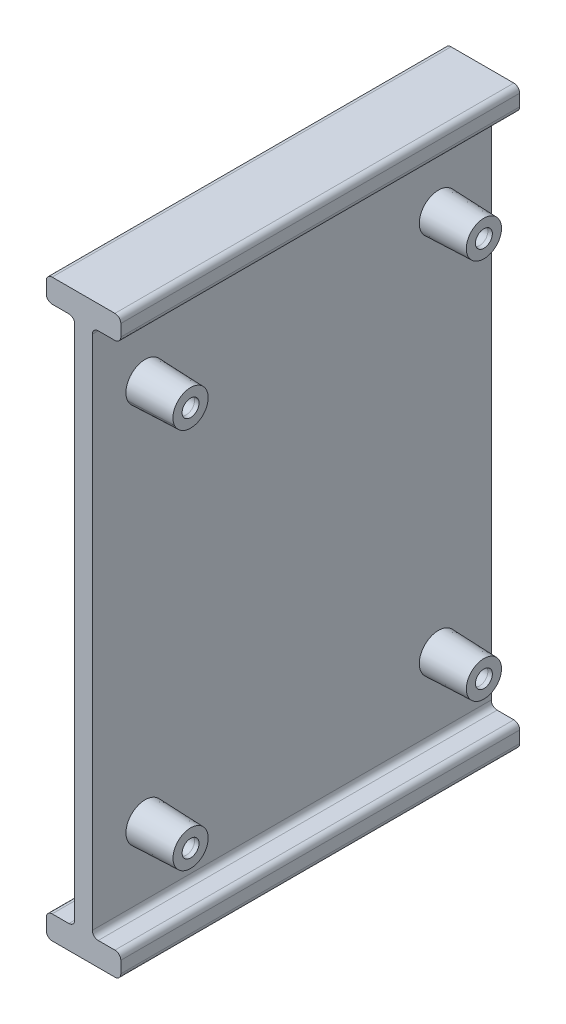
ISO-10303-21;
HEADER;
FILE_DESCRIPTION(('STEP AP214'),'2;1');
FILE_NAME('part.step','',(''),(''),'','','');
FILE_SCHEMA(('AUTOMOTIVE_DESIGN { 1 0 10303 214 1 1 1 1 }'));
ENDSEC;
DATA;
#1=APPLICATION_CONTEXT('core data for automotive mechanical design processes');
#2=APPLICATION_PROTOCOL_DEFINITION('international standard','automotive_design',2000,#1);
#3=PRODUCT_CONTEXT('',#1,'mechanical');
#4=PRODUCT('Part','Part','',(#3));
#5=PRODUCT_RELATED_PRODUCT_CATEGORY('part','',(#4));
#6=PRODUCT_DEFINITION_FORMATION('','',#4);
#7=PRODUCT_DEFINITION_CONTEXT('part definition',#1,'design');
#8=PRODUCT_DEFINITION('design','',#6,#7);
#9=PRODUCT_DEFINITION_SHAPE('','',#8);
#10=(LENGTH_UNIT() NAMED_UNIT(*) SI_UNIT(.MILLI.,.METRE.));
#11=(NAMED_UNIT(*) PLANE_ANGLE_UNIT() SI_UNIT($,.RADIAN.));
#12=(NAMED_UNIT(*) SI_UNIT($,.STERADIAN.) SOLID_ANGLE_UNIT());
#13=UNCERTAINTY_MEASURE_WITH_UNIT(LENGTH_MEASURE(1.E-05),#10,'distance_accuracy_value','');
#14=(GEOMETRIC_REPRESENTATION_CONTEXT(3) GLOBAL_UNCERTAINTY_ASSIGNED_CONTEXT((#13)) GLOBAL_UNIT_ASSIGNED_CONTEXT((#10,
#11,#12)) REPRESENTATION_CONTEXT('',''));
#15=CARTESIAN_POINT('',(0.,0.,0.));
#16=DIRECTION('',(0.,0.,1.));
#17=DIRECTION('',(1.,0.,0.));
#18=AXIS2_PLACEMENT_3D('',#15,#16,#17);
#19=CARTESIAN_POINT('',(8.5,32.5035799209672,25.0016124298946));
#20=DIRECTION('',(1.,0.,0.));
#21=DIRECTION('',(0.,0.,-1.));
#22=AXIS2_PLACEMENT_3D('',#19,#20,#21);
#23=PLANE('',#22);
#24=CARTESIAN_POINT('',(8.5,32.5035799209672,25.0016124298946));
#25=DIRECTION('',(1.,0.,0.));
#26=DIRECTION('',(0.,0.,-1.));
#27=AXIS2_PLACEMENT_3D('',#24,#25,#26);
#28=CIRCLE('',#27,1.42381407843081);
#29=CARTESIAN_POINT('',(8.5,31.9170656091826,26.299012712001));
#30=VERTEX_POINT('',#29);
#31=CARTESIAN_POINT('',(8.5,33.0865143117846,23.7025997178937));
#32=VERTEX_POINT('',#31);
#33=EDGE_CURVE('E257',#30,#32,#28,.T.);
#34=ORIENTED_EDGE('',*,*,#33,.T.);
#35=CARTESIAN_POINT('',(8.5,32.5,25.));
#36=DIRECTION('',(1.,0.,0.));
#37=DIRECTION('',(0.,0.,-1.));
#38=AXIS2_PLACEMENT_3D('',#35,#36,#37);
#39=CIRCLE('',#38,1.42381407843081);
#40=EDGE_CURVE('E264',#32,#30,#39,.T.);
#41=ORIENTED_EDGE('',*,*,#40,.T.);
#42=EDGE_LOOP('',(#34,#41));
#43=FACE_BOUND('',#42,.T.);
#44=CARTESIAN_POINT('',(8.5,32.5,25.));
#45=DIRECTION('',(-1.,0.,0.));
#46=DIRECTION('',(0.,0.,1.));
#47=AXIS2_PLACEMENT_3D('',#44,#45,#46);
#48=CIRCLE('',#47,1.45);
#49=CARTESIAN_POINT('',(8.5,31.9063116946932,26.3228885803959));
#50=VERTEX_POINT('',#49);
#51=CARTESIAN_POINT('',(8.5,33.0972682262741,23.6787238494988));
#52=VERTEX_POINT('',#51);
#53=EDGE_CURVE('E269',#50,#52,#48,.T.);
#54=ORIENTED_EDGE('',*,*,#53,.T.);
#55=CARTESIAN_POINT('',(8.5,32.5035799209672,25.0016124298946));
#56=DIRECTION('',(-1.,0.,0.));
#57=DIRECTION('',(0.,0.,1.));
#58=AXIS2_PLACEMENT_3D('',#55,#56,#57);
#59=CIRCLE('',#58,1.45);
#60=EDGE_CURVE('E285',#52,#50,#59,.T.);
#61=ORIENTED_EDGE('',*,*,#60,.T.);
#62=EDGE_LOOP('',(#54,#61));
#63=FACE_BOUND('',#62,.T.);
#64=ADVANCED_FACE('F45',(#43,#63),#23,.F.);
#65=CARTESIAN_POINT('',(2.5,32.5035799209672,25.0016124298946));
#66=DIRECTION('',(-1.,0.,0.));
#67=DIRECTION('',(0.,0.,1.));
#68=AXIS2_PLACEMENT_3D('',#65,#66,#67);
#69=PLANE('',#68);
#70=CARTESIAN_POINT('',(2.5,32.5,25.));
#71=DIRECTION('',(1.,0.,0.));
#72=DIRECTION('',(0.,0.,-1.));
#73=AXIS2_PLACEMENT_3D('',#70,#71,#72);
#74=CIRCLE('',#73,1.34526961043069);
#75=CARTESIAN_POINT('',(2.5,33.0542580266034,23.7742152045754));
#76=VERTEX_POINT('',#75);
#77=CARTESIAN_POINT('',(2.5,31.9493218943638,26.2273972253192));
#78=VERTEX_POINT('',#77);
#79=EDGE_CURVE('E277',#76,#78,#74,.T.);
#80=ORIENTED_EDGE('',*,*,#79,.T.);
#81=CARTESIAN_POINT('',(2.5,32.5035799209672,25.0016124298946));
#82=DIRECTION('',(1.,0.,0.));
#83=DIRECTION('',(0.,0.,-1.));
#84=AXIS2_PLACEMENT_3D('',#81,#82,#83);
#85=CIRCLE('',#84,1.34526961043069);
#86=EDGE_CURVE('E282',#78,#76,#85,.T.);
#87=ORIENTED_EDGE('',*,*,#86,.T.);
#88=EDGE_LOOP('',(#80,#87));
#89=FACE_BOUND('',#88,.T.);
#90=ADVANCED_FACE('F522',(#89),#69,.F.);
#91=CARTESIAN_POINT('',(2.5,32.5035799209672,25.0016124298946));
#92=DIRECTION('',(1.,0.,0.));
#93=DIRECTION('',(0.,0.,-1.));
#94=AXIS2_PLACEMENT_3D('',#91,#92,#93);
#95=CONICAL_SURFACE('',#94,1.34526961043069,0.0174532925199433);
#96=CARTESIAN_POINT('',(9.1002,31.902009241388,26.3324408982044));
#97=CARTESIAN_POINT('',(8.14339580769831,31.9088679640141,26.3172131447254));
#98=CARTESIAN_POINT('',(7.18659161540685,31.915726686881,26.3019853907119));
#99=CARTESIAN_POINT('',(4.78645828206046,31.9329317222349,26.2637867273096));
#100=CARTESIAN_POINT('',(3.34312914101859,31.943278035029,26.240815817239));
#101=CARTESIAN_POINT('',(1.8998,31.953624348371,26.2178449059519));
#102=B_SPLINE_CURVE_WITH_KNOTS('',3,(#96,#97,#98,#99,#100,#101),.UNSPECIFIED.,.F.,.F.,(4,2,4),
(0.,2.87084982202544,7.20149682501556),.UNSPECIFIED.);
#103=EDGE_CURVE('E507',#50,#78,#102,.T.);
#104=ORIENTED_EDGE('',*,*,#103,.F.);
#105=ORIENTED_EDGE('',*,*,#60,.F.);
#106=CARTESIAN_POINT('',(1.8998,33.0499555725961,23.7837675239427));
#107=CARTESIAN_POINT('',(2.77426500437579,33.0562240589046,23.7698502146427));
#108=CARTESIAN_POINT('',(3.64873000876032,33.0624925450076,23.7559329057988));
#109=CARTESIAN_POINT('',(6.04886334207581,33.0796975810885,23.7177342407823));
#110=CARTESIAN_POINT('',(7.57453167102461,33.0906341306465,23.693452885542));
#111=CARTESIAN_POINT('',(9.1002,33.1015706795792,23.6691715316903));
#112=B_SPLINE_CURVE_WITH_KNOTS('',3,(#106,#107,#108,#109,#110,#111),.UNSPECIFIED.,.F.,.F.,(4,2,
4),(0.,2.62379463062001,7.20149682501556),.UNSPECIFIED.);
#113=EDGE_CURVE('E500',#76,#52,#112,.T.);
#114=ORIENTED_EDGE('',*,*,#113,.F.);
#115=ORIENTED_EDGE('',*,*,#86,.F.);
#116=EDGE_LOOP('',(#104,#105,#114,#115));
#117=FACE_BOUND('',#116,.T.);
#118=ADVANCED_FACE('F517',(#117),#95,.F.);
#119=CARTESIAN_POINT('',(8.5,32.5035799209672,25.0016124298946));
#120=DIRECTION('',(1.,0.,0.));
#121=DIRECTION('',(0.,0.,-1.));
#122=AXIS2_PLACEMENT_3D('',#119,#120,#121);
#123=CONICAL_SURFACE('',#122,1.42381407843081,0.0261799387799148);
#124=CARTESIAN_POINT('',(9.32080000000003,31.9082387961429,26.3186100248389));
#125=CARTESIAN_POINT('',(9.17153333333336,31.9098439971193,26.3150461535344));
#126=CARTESIAN_POINT('',(9.02226666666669,31.9114491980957,26.31148228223));
#127=CARTESIAN_POINT('',(8.72373333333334,31.9146596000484,26.304354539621));
#128=CARTESIAN_POINT('',(8.57446666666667,31.9162648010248,26.3007906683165));
#129=CARTESIAN_POINT('',(8.42519999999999,31.9178700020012,26.297226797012));
#130=B_SPLINE_CURVE_WITH_KNOTS('',3,(#124,#125,#126,#127,#128,#129),.UNSPECIFIED.,.F.,.F.,(4,2,
4),(0.,0.447953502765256,0.895907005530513),.UNSPECIFIED.);
#131=CARTESIAN_POINT('',(9.24600000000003,31.9090431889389,26.3168241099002));
#132=VERTEX_POINT('',#131);
#133=EDGE_CURVE('E252',#132,#30,#130,.T.);
#134=ORIENTED_EDGE('',*,*,#133,.F.);
#135=CARTESIAN_POINT('',(9.24600000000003,32.5035799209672,25.0016124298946));
#136=DIRECTION('',(1.,0.,0.));
#137=DIRECTION('',(0.,1.,0.));
#138=AXIS2_PLACEMENT_3D('',#135,#136,#137);
#139=CIRCLE('',#138,1.44334877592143);
#140=CARTESIAN_POINT('',(9.24600000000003,33.0945367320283,23.6847883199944));
#141=VERTEX_POINT('',#140);
#142=EDGE_CURVE('E246',#132,#141,#139,.T.);
#143=ORIENTED_EDGE('',*,*,#142,.T.);
#144=CARTESIAN_POINT('',(8.42519999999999,33.0857099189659,23.7043856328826));
#145=CARTESIAN_POINT('',(8.57446666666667,33.0873151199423,23.7008217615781));
#146=CARTESIAN_POINT('',(8.72373333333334,33.0889203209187,23.6972578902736));
#147=CARTESIAN_POINT('',(9.02226666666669,33.0921307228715,23.6901301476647));
#148=CARTESIAN_POINT('',(9.17153333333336,33.0937359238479,23.6865662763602));
#149=CARTESIAN_POINT('',(9.32080000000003,33.0953411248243,23.6830024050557));
#150=B_SPLINE_CURVE_WITH_KNOTS('',3,(#144,#145,#146,#147,#148,#149),.UNSPECIFIED.,.F.,.F.,(4,2,
4),(0.,0.447953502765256,0.895907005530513),.UNSPECIFIED.);
#151=EDGE_CURVE('E249',#32,#141,#150,.T.);
#152=ORIENTED_EDGE('',*,*,#151,.F.);
#153=ORIENTED_EDGE('',*,*,#33,.F.);
#154=EDGE_LOOP('',(#134,#143,#152,#153));
#155=FACE_BOUND('',#154,.T.);
#156=ADVANCED_FACE('F248',(#155),#123,.F.);
#157=CARTESIAN_POINT('',(-5.35,-48.,34.));
#158=DIRECTION('',(0.,0.,-1.));
#159=DIRECTION('',(-1.,0.,0.));
#160=AXIS2_PLACEMENT_3D('',#157,#158,#159);
#161=CYLINDRICAL_SURFACE('',#160,1.);
#162=CARTESIAN_POINT('',(-5.35,-48.,-34.));
#163=DIRECTION('',(0.,0.,1.));
#164=DIRECTION('',(1.,0.,0.));
#165=AXIS2_PLACEMENT_3D('',#162,#163,#164);
#166=CIRCLE('',#165,1.);
#167=CARTESIAN_POINT('',(-5.34999999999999,-49.,-34.));
#168=VERTEX_POINT('',#167);
#169=CARTESIAN_POINT('',(-6.35,-48.,-34.));
#170=VERTEX_POINT('',#169);
#171=EDGE_CURVE('E292',#168,#170,#166,.F.);
#172=ORIENTED_EDGE('',*,*,#171,.F.);
#173=DIRECTION('',(0.,0.,-1.));
#174=VECTOR('',#173,1.);
#175=CARTESIAN_POINT('',(-5.34999999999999,-49.,34.));
#176=LINE('',#175,#174);
#177=CARTESIAN_POINT('',(-5.34999999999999,-49.,34.));
#178=VERTEX_POINT('',#177);
#179=EDGE_CURVE('E265',#178,#168,#176,.T.);
#180=ORIENTED_EDGE('',*,*,#179,.F.);
#181=CARTESIAN_POINT('',(-5.35,-48.,34.));
#182=DIRECTION('',(0.,0.,1.));
#183=DIRECTION('',(1.,0.,0.));
#184=AXIS2_PLACEMENT_3D('',#181,#182,#183);
#185=CIRCLE('',#184,1.);
#186=CARTESIAN_POINT('',(-6.35,-48.,34.));
#187=VERTEX_POINT('',#186);
#188=EDGE_CURVE('E293',#178,#187,#185,.F.);
#189=ORIENTED_EDGE('',*,*,#188,.T.);
#190=DIRECTION('',(0.,0.,-1.));
#191=VECTOR('',#190,1.);
#192=CARTESIAN_POINT('',(-6.35,-48.,34.));
#193=LINE('',#192,#191);
#194=EDGE_CURVE('E355',#187,#170,#193,.T.);
#195=ORIENTED_EDGE('',*,*,#194,.T.);
#196=EDGE_LOOP('',(#172,#180,#189,#195));
#197=FACE_BOUND('',#196,.T.);
#198=ADVANCED_FACE('F47',(#197),#161,.T.);
#199=CARTESIAN_POINT('',(0.,-49.,34.));
#200=DIRECTION('',(0.,1.,0.));
#201=DIRECTION('',(0.,0.,1.));
#202=AXIS2_PLACEMENT_3D('',#199,#200,#201);
#203=PLANE('',#202);
#204=DIRECTION('',(1.,0.,0.));
#205=VECTOR('',#204,1.);
#206=CARTESIAN_POINT('',(0.,-49.,-34.));
#207=LINE('',#206,#205);
#208=CARTESIAN_POINT('',(5.34999999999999,-49.,-34.));
#209=VERTEX_POINT('',#208);
#210=EDGE_CURVE('E358',#168,#209,#207,.T.);
#211=ORIENTED_EDGE('',*,*,#210,.T.);
#212=DIRECTION('',(0.,0.,-1.));
#213=VECTOR('',#212,1.);
#214=CARTESIAN_POINT('',(5.34999999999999,-49.,34.));
#215=LINE('',#214,#213);
#216=CARTESIAN_POINT('',(5.34999999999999,-49.,34.));
#217=VERTEX_POINT('',#216);
#218=EDGE_CURVE('E468',#217,#209,#215,.T.);
#219=ORIENTED_EDGE('',*,*,#218,.F.);
#220=DIRECTION('',(1.,0.,0.));
#221=VECTOR('',#220,1.);
#222=CARTESIAN_POINT('',(0.,-49.,34.));
#223=LINE('',#222,#221);
#224=EDGE_CURVE('E296',#178,#217,#223,.T.);
#225=ORIENTED_EDGE('',*,*,#224,.F.);
#226=ORIENTED_EDGE('',*,*,#179,.T.);
#227=EDGE_LOOP('',(#211,#219,#225,#226));
#228=FACE_BOUND('',#227,.T.);
#229=ADVANCED_FACE('F625',(#228),#203,.F.);
#230=CARTESIAN_POINT('',(5.35,-48.,34.));
#231=DIRECTION('',(0.,0.,-1.));
#232=DIRECTION('',(-1.,0.,0.));
#233=AXIS2_PLACEMENT_3D('',#230,#231,#232);
#234=CYLINDRICAL_SURFACE('',#233,1.);
#235=CARTESIAN_POINT('',(5.35,-48.,-34.));
#236=DIRECTION('',(0.,0.,1.));
#237=DIRECTION('',(1.,0.,0.));
#238=AXIS2_PLACEMENT_3D('',#235,#236,#237);
#239=CIRCLE('',#238,1.);
#240=CARTESIAN_POINT('',(6.35,-48.,-34.));
#241=VERTEX_POINT('',#240);
#242=EDGE_CURVE('E360',#209,#241,#239,.T.);
#243=ORIENTED_EDGE('',*,*,#242,.T.);
#244=DIRECTION('',(0.,0.,-1.));
#245=VECTOR('',#244,1.);
#246=CARTESIAN_POINT('',(6.35,-48.,34.));
#247=LINE('',#246,#245);
#248=CARTESIAN_POINT('',(6.35,-48.,34.));
#249=VERTEX_POINT('',#248);
#250=EDGE_CURVE('E465',#249,#241,#247,.T.);
#251=ORIENTED_EDGE('',*,*,#250,.F.);
#252=CARTESIAN_POINT('',(5.35,-48.,34.));
#253=DIRECTION('',(0.,0.,1.));
#254=DIRECTION('',(1.,0.,0.));
#255=AXIS2_PLACEMENT_3D('',#252,#253,#254);
#256=CIRCLE('',#255,1.);
#257=EDGE_CURVE('E299',#217,#249,#256,.T.);
#258=ORIENTED_EDGE('',*,*,#257,.F.);
#259=ORIENTED_EDGE('',*,*,#218,.T.);
#260=EDGE_LOOP('',(#243,#251,#258,#259));
#261=FACE_BOUND('',#260,.T.);
#262=ADVANCED_FACE('F622',(#261),#234,.T.);
#263=CARTESIAN_POINT('',(6.35,0.,34.));
#264=DIRECTION('',(-1.,0.,0.));
#265=DIRECTION('',(0.,0.,1.));
#266=AXIS2_PLACEMENT_3D('',#263,#264,#265);
#267=PLANE('',#266);
#268=DIRECTION('',(0.,1.,0.));
#269=VECTOR('',#268,1.);
#270=CARTESIAN_POINT('',(6.35,0.,-34.));
#271=LINE('',#270,#269);
#272=CARTESIAN_POINT('',(6.35,-46.,-34.));
#273=VERTEX_POINT('',#272);
#274=EDGE_CURVE('E362',#241,#273,#271,.T.);
#275=ORIENTED_EDGE('',*,*,#274,.T.);
#276=DIRECTION('',(0.,0.,-1.));
#277=VECTOR('',#276,1.);
#278=CARTESIAN_POINT('',(6.35,-46.,34.));
#279=LINE('',#278,#277);
#280=CARTESIAN_POINT('',(6.35,-46.,34.));
#281=VERTEX_POINT('',#280);
#282=EDGE_CURVE('E463',#281,#273,#279,.T.);
#283=ORIENTED_EDGE('',*,*,#282,.F.);
#284=DIRECTION('',(0.,1.,0.));
#285=VECTOR('',#284,1.);
#286=CARTESIAN_POINT('',(6.35,0.,34.));
#287=LINE('',#286,#285);
#288=EDGE_CURVE('E301',#249,#281,#287,.T.);
#289=ORIENTED_EDGE('',*,*,#288,.F.);
#290=ORIENTED_EDGE('',*,*,#250,.T.);
#291=EDGE_LOOP('',(#275,#283,#289,#290));
#292=FACE_BOUND('',#291,.T.);
#293=ADVANCED_FACE('F618',(#292),#267,.F.);
#294=CARTESIAN_POINT('',(5.35,-46.,34.));
#295=DIRECTION('',(0.,0.,-1.));
#296=DIRECTION('',(-1.,0.,0.));
#297=AXIS2_PLACEMENT_3D('',#294,#295,#296);
#298=CYLINDRICAL_SURFACE('',#297,1.);
#299=CARTESIAN_POINT('',(5.35,-46.,-34.));
#300=DIRECTION('',(0.,0.,1.));
#301=DIRECTION('',(1.,0.,0.));
#302=AXIS2_PLACEMENT_3D('',#299,#300,#301);
#303=CIRCLE('',#302,1.);
#304=CARTESIAN_POINT('',(5.35,-45.,-34.));
#305=VERTEX_POINT('',#304);
#306=EDGE_CURVE('E365',#305,#273,#303,.F.);
#307=ORIENTED_EDGE('',*,*,#306,.F.);
#308=DIRECTION('',(0.,0.,-1.));
#309=VECTOR('',#308,1.);
#310=CARTESIAN_POINT('',(5.35,-45.,34.));
#311=LINE('',#310,#309);
#312=CARTESIAN_POINT('',(5.35,-45.,34.));
#313=VERTEX_POINT('',#312);
#314=EDGE_CURVE('E461',#313,#305,#311,.T.);
#315=ORIENTED_EDGE('',*,*,#314,.F.);
#316=CARTESIAN_POINT('',(5.35,-46.,34.));
#317=DIRECTION('',(0.,0.,1.));
#318=DIRECTION('',(1.,0.,0.));
#319=AXIS2_PLACEMENT_3D('',#316,#317,#318);
#320=CIRCLE('',#319,1.);
#321=EDGE_CURVE('E303',#313,#281,#320,.F.);
#322=ORIENTED_EDGE('',*,*,#321,.T.);
#323=ORIENTED_EDGE('',*,*,#282,.T.);
#324=EDGE_LOOP('',(#307,#315,#322,#323));
#325=FACE_BOUND('',#324,.T.);
#326=ADVANCED_FACE('F614',(#325),#298,.T.);
#327=CARTESIAN_POINT('',(-1.09561482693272E-13,-45.,34.));
#328=DIRECTION('',(0.,1.,0.));
#329=DIRECTION('',(-1.,0.,0.));
#330=AXIS2_PLACEMENT_3D('',#327,#328,#329);
#331=PLANE('',#330);
#332=DIRECTION('',(1.,0.,0.));
#333=VECTOR('',#332,1.);
#334=CARTESIAN_POINT('',(-1.09561482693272E-13,-45.,-34.));
#335=LINE('',#334,#333);
#336=CARTESIAN_POINT('',(2.50000000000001,-45.,-34.));
#337=VERTEX_POINT('',#336);
#338=EDGE_CURVE('E368',#337,#305,#335,.T.);
#339=ORIENTED_EDGE('',*,*,#338,.F.);
#340=DIRECTION('',(0.,0.,-1.));
#341=VECTOR('',#340,1.);
#342=CARTESIAN_POINT('',(2.50000000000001,-45.,34.));
#343=LINE('',#342,#341);
#344=CARTESIAN_POINT('',(2.50000000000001,-45.,34.));
#345=VERTEX_POINT('',#344);
#346=EDGE_CURVE('E459',#345,#337,#343,.T.);
#347=ORIENTED_EDGE('',*,*,#346,.F.);
#348=DIRECTION('',(1.,0.,0.));
#349=VECTOR('',#348,1.);
#350=CARTESIAN_POINT('',(-1.09561482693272E-13,-45.,34.));
#351=LINE('',#350,#349);
#352=EDGE_CURVE('E306',#345,#313,#351,.T.);
#353=ORIENTED_EDGE('',*,*,#352,.T.);
#354=ORIENTED_EDGE('',*,*,#314,.T.);
#355=EDGE_LOOP('',(#339,#347,#353,#354));
#356=FACE_BOUND('',#355,.T.);
#357=ADVANCED_FACE('F610',(#356),#331,.T.);
#358=CARTESIAN_POINT('',(2.5,-44.,34.));
#359=DIRECTION('',(0.,0.,-1.));
#360=DIRECTION('',(-1.,0.,0.));
#361=AXIS2_PLACEMENT_3D('',#358,#359,#360);
#362=CYLINDRICAL_SURFACE('',#361,1.);
#363=CARTESIAN_POINT('',(2.5,-44.,-34.));
#364=DIRECTION('',(0.,0.,1.));
#365=DIRECTION('',(1.,0.,0.));
#366=AXIS2_PLACEMENT_3D('',#363,#364,#365);
#367=CIRCLE('',#366,1.);
#368=CARTESIAN_POINT('',(1.5,-44.,-34.));
#369=VERTEX_POINT('',#368);
#370=EDGE_CURVE('E371',#337,#369,#367,.F.);
#371=ORIENTED_EDGE('',*,*,#370,.T.);
#372=DIRECTION('',(0.,0.,-1.));
#373=VECTOR('',#372,1.);
#374=CARTESIAN_POINT('',(1.5,-44.,34.));
#375=LINE('',#374,#373);
#376=CARTESIAN_POINT('',(1.5,-44.,34.));
#377=VERTEX_POINT('',#376);
#378=EDGE_CURVE('E456',#377,#369,#375,.T.);
#379=ORIENTED_EDGE('',*,*,#378,.F.);
#380=CARTESIAN_POINT('',(2.5,-44.,34.));
#381=DIRECTION('',(0.,0.,1.));
#382=DIRECTION('',(1.,0.,0.));
#383=AXIS2_PLACEMENT_3D('',#380,#381,#382);
#384=CIRCLE('',#383,1.);
#385=EDGE_CURVE('E309',#345,#377,#384,.F.);
#386=ORIENTED_EDGE('',*,*,#385,.F.);
#387=ORIENTED_EDGE('',*,*,#346,.T.);
#388=EDGE_LOOP('',(#371,#379,#386,#387));
#389=FACE_BOUND('',#388,.T.);
#390=ADVANCED_FACE('F606',(#389),#362,.F.);
#391=CARTESIAN_POINT('',(1.5,0.,34.));
#392=DIRECTION('',(-1.,0.,0.));
#393=DIRECTION('',(0.,-1.,0.));
#394=AXIS2_PLACEMENT_3D('',#391,#392,#393);
#395=PLANE('',#394);
#396=CARTESIAN_POINT('',(1.49999999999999,-32.5,25.));
#397=DIRECTION('',(-1.,0.,0.));
#398=DIRECTION('',(0.,-1.,0.));
#399=AXIS2_PLACEMENT_3D('',#396,#397,#398);
#400=CIRCLE('',#399,3.27056445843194);
#401=CARTESIAN_POINT('',(1.49999999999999,-35.7705644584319,25.));
#402=VERTEX_POINT('',#401);
#403=EDGE_CURVE('E1142',#402,#402,#400,.F.);
#404=ORIENTED_EDGE('',*,*,#403,.F.);
#405=EDGE_LOOP('',(#404));
#406=FACE_BOUND('',#405,.T.);
#407=CARTESIAN_POINT('',(1.49999999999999,-32.5,-25.));
#408=DIRECTION('',(-1.,0.,0.));
#409=DIRECTION('',(0.,-1.,0.));
#410=AXIS2_PLACEMENT_3D('',#407,#408,#409);
#411=CIRCLE('',#410,3.27056445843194);
#412=CARTESIAN_POINT('',(1.49999999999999,-35.770564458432,-25.));
#413=VERTEX_POINT('',#412);
#414=EDGE_CURVE('E1151',#413,#413,#411,.F.);
#415=ORIENTED_EDGE('',*,*,#414,.F.);
#416=EDGE_LOOP('',(#415));
#417=FACE_BOUND('',#416,.T.);
#418=CARTESIAN_POINT('',(1.49999999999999,32.5,-25.));
#419=DIRECTION('',(-1.,0.,0.));
#420=DIRECTION('',(0.,-1.,0.));
#421=AXIS2_PLACEMENT_3D('',#418,#419,#420);
#422=CIRCLE('',#421,3.27056445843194);
#423=CARTESIAN_POINT('',(1.49999999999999,29.2294355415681,-25.));
#424=VERTEX_POINT('',#423);
#425=EDGE_CURVE('E1169',#424,#424,#422,.F.);
#426=ORIENTED_EDGE('',*,*,#425,.F.);
#427=EDGE_LOOP('',(#426));
#428=FACE_BOUND('',#427,.T.);
#429=CARTESIAN_POINT('',(1.49999999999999,32.5035799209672,25.0016124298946));
#430=DIRECTION('',(-1.,0.,0.));
#431=DIRECTION('',(0.,-1.,0.));
#432=AXIS2_PLACEMENT_3D('',#429,#430,#431);
#433=CIRCLE('',#432,3.27056445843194);
#434=CARTESIAN_POINT('',(1.49999999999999,33.844928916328,22.0187656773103));
#435=VERTEX_POINT('',#434);
#436=CARTESIAN_POINT('',(1.49999999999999,31.1586510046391,27.9828467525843));
#437=VERTEX_POINT('',#436);
#438=EDGE_CURVE('E290',#435,#437,#433,.F.);
#439=ORIENTED_EDGE('',*,*,#438,.F.);
#440=CARTESIAN_POINT('',(1.49999999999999,32.5,25.));
#441=DIRECTION('',(-1.,0.,0.));
#442=DIRECTION('',(0.,-1.,0.));
#443=AXIS2_PLACEMENT_3D('',#440,#441,#442);
#444=CIRCLE('',#443,3.27056445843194);
#445=EDGE_CURVE('E65',#437,#435,#444,.F.);
#446=ORIENTED_EDGE('',*,*,#445,.F.);
#447=EDGE_LOOP('',(#439,#446));
#448=FACE_BOUND('',#447,.T.);
#449=DIRECTION('',(0.,1.,0.));
#450=VECTOR('',#449,1.);
#451=CARTESIAN_POINT('',(1.5,0.,-34.));
#452=LINE('',#451,#450);
#453=CARTESIAN_POINT('',(1.49999999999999,44.,-34.));
#454=VERTEX_POINT('',#453);
#455=EDGE_CURVE('E373',#369,#454,#452,.T.);
#456=ORIENTED_EDGE('',*,*,#455,.T.);
#457=DIRECTION('',(0.,0.,-1.));
#458=VECTOR('',#457,1.);
#459=CARTESIAN_POINT('',(1.49999999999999,44.,34.));
#460=LINE('',#459,#458);
#461=CARTESIAN_POINT('',(1.49999999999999,44.,34.));
#462=VERTEX_POINT('',#461);
#463=EDGE_CURVE('E454',#462,#454,#460,.T.);
#464=ORIENTED_EDGE('',*,*,#463,.F.);
#465=DIRECTION('',(0.,1.,0.));
#466=VECTOR('',#465,1.);
#467=CARTESIAN_POINT('',(1.5,0.,34.));
#468=LINE('',#467,#466);
#469=EDGE_CURVE('E311',#377,#462,#468,.T.);
#470=ORIENTED_EDGE('',*,*,#469,.F.);
#471=ORIENTED_EDGE('',*,*,#378,.T.);
#472=EDGE_LOOP('',(#456,#464,#470,#471));
#473=FACE_BOUND('',#472,.T.);
#474=ADVANCED_FACE('F602',(#406,#417,#428,#448,#473),#395,.F.);
#475=CARTESIAN_POINT('',(2.49999999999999,44.,34.));
#476=DIRECTION('',(0.,0.,-1.));
#477=DIRECTION('',(-1.,0.,0.));
#478=AXIS2_PLACEMENT_3D('',#475,#476,#477);
#479=CYLINDRICAL_SURFACE('',#478,1.);
#480=CARTESIAN_POINT('',(2.49999999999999,44.,-34.));
#481=DIRECTION('',(0.,0.,1.));
#482=DIRECTION('',(1.,0.,0.));
#483=AXIS2_PLACEMENT_3D('',#480,#481,#482);
#484=CIRCLE('',#483,1.);
#485=CARTESIAN_POINT('',(2.5,45.,-34.));
#486=VERTEX_POINT('',#485);
#487=EDGE_CURVE('E376',#486,#454,#484,.T.);
#488=ORIENTED_EDGE('',*,*,#487,.F.);
#489=DIRECTION('',(0.,0.,-1.));
#490=VECTOR('',#489,1.);
#491=CARTESIAN_POINT('',(2.5,45.,34.));
#492=LINE('',#491,#490);
#493=CARTESIAN_POINT('',(2.5,45.,34.));
#494=VERTEX_POINT('',#493);
#495=EDGE_CURVE('E452',#494,#486,#492,.T.);
#496=ORIENTED_EDGE('',*,*,#495,.F.);
#497=CARTESIAN_POINT('',(2.49999999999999,44.,34.));
#498=DIRECTION('',(0.,0.,1.));
#499=DIRECTION('',(1.,0.,0.));
#500=AXIS2_PLACEMENT_3D('',#497,#498,#499);
#501=CIRCLE('',#500,1.);
#502=EDGE_CURVE('E313',#494,#462,#501,.T.);
#503=ORIENTED_EDGE('',*,*,#502,.T.);
#504=ORIENTED_EDGE('',*,*,#463,.T.);
#505=EDGE_LOOP('',(#488,#496,#503,#504));
#506=FACE_BOUND('',#505,.T.);
#507=ADVANCED_FACE('F598',(#506),#479,.F.);
#508=CARTESIAN_POINT('',(-1.09561482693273E-13,45.,34.));
#509=DIRECTION('',(0.,1.,0.));
#510=DIRECTION('',(-1.,0.,0.));
#511=AXIS2_PLACEMENT_3D('',#508,#509,#510);
#512=PLANE('',#511);
#513=DIRECTION('',(1.,0.,0.));
#514=VECTOR('',#513,1.);
#515=CARTESIAN_POINT('',(-1.09561482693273E-13,45.,-34.));
#516=LINE('',#515,#514);
#517=CARTESIAN_POINT('',(5.34999999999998,45.,-34.));
#518=VERTEX_POINT('',#517);
#519=EDGE_CURVE('E379',#486,#518,#516,.T.);
#520=ORIENTED_EDGE('',*,*,#519,.T.);
#521=DIRECTION('',(0.,0.,-1.));
#522=VECTOR('',#521,1.);
#523=CARTESIAN_POINT('',(5.34999999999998,45.,34.));
#524=LINE('',#523,#522);
#525=CARTESIAN_POINT('',(5.34999999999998,45.,34.));
#526=VERTEX_POINT('',#525);
#527=EDGE_CURVE('E449',#526,#518,#524,.T.);
#528=ORIENTED_EDGE('',*,*,#527,.F.);
#529=DIRECTION('',(1.,0.,0.));
#530=VECTOR('',#529,1.);
#531=CARTESIAN_POINT('',(-1.09561482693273E-13,45.,34.));
#532=LINE('',#531,#530);
#533=EDGE_CURVE('E316',#494,#526,#532,.T.);
#534=ORIENTED_EDGE('',*,*,#533,.F.);
#535=ORIENTED_EDGE('',*,*,#495,.T.);
#536=EDGE_LOOP('',(#520,#528,#534,#535));
#537=FACE_BOUND('',#536,.T.);
#538=ADVANCED_FACE('F594',(#537),#512,.F.);
#539=CARTESIAN_POINT('',(5.34999999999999,46.,34.));
#540=DIRECTION('',(0.,0.,-1.));
#541=DIRECTION('',(-1.,0.,0.));
#542=AXIS2_PLACEMENT_3D('',#539,#540,#541);
#543=CYLINDRICAL_SURFACE('',#542,1.);
#544=CARTESIAN_POINT('',(5.34999999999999,46.,-34.));
#545=DIRECTION('',(0.,0.,1.));
#546=DIRECTION('',(1.,0.,0.));
#547=AXIS2_PLACEMENT_3D('',#544,#545,#546);
#548=CIRCLE('',#547,1.);
#549=CARTESIAN_POINT('',(6.34999999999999,46.,-34.));
#550=VERTEX_POINT('',#549);
#551=EDGE_CURVE('E381',#518,#550,#548,.T.);
#552=ORIENTED_EDGE('',*,*,#551,.T.);
#553=DIRECTION('',(0.,0.,-1.));
#554=VECTOR('',#553,1.);
#555=CARTESIAN_POINT('',(6.34999999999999,46.,34.));
#556=LINE('',#555,#554);
#557=CARTESIAN_POINT('',(6.34999999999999,46.,34.));
#558=VERTEX_POINT('',#557);
#559=EDGE_CURVE('E447',#558,#550,#556,.T.);
#560=ORIENTED_EDGE('',*,*,#559,.F.);
#561=CARTESIAN_POINT('',(5.34999999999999,46.,34.));
#562=DIRECTION('',(0.,0.,1.));
#563=DIRECTION('',(1.,0.,0.));
#564=AXIS2_PLACEMENT_3D('',#561,#562,#563);
#565=CIRCLE('',#564,1.);
#566=EDGE_CURVE('E318',#526,#558,#565,.T.);
#567=ORIENTED_EDGE('',*,*,#566,.F.);
#568=ORIENTED_EDGE('',*,*,#527,.T.);
#569=EDGE_LOOP('',(#552,#560,#567,#568));
#570=FACE_BOUND('',#569,.T.);
#571=ADVANCED_FACE('F590',(#570),#543,.T.);
#572=CARTESIAN_POINT('',(6.35000000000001,0.,34.));
#573=DIRECTION('',(1.,0.,0.));
#574=DIRECTION('',(0.,1.,0.));
#575=AXIS2_PLACEMENT_3D('',#572,#573,#574);
#576=PLANE('',#575);
#577=DIRECTION('',(0.,-1.,0.));
#578=VECTOR('',#577,1.);
#579=CARTESIAN_POINT('',(6.35000000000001,0.,-34.));
#580=LINE('',#579,#578);
#581=CARTESIAN_POINT('',(6.34999999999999,48.,-34.));
#582=VERTEX_POINT('',#581);
#583=EDGE_CURVE('E384',#582,#550,#580,.T.);
#584=ORIENTED_EDGE('',*,*,#583,.F.);
#585=DIRECTION('',(0.,0.,-1.));
#586=VECTOR('',#585,1.);
#587=CARTESIAN_POINT('',(6.34999999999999,48.,34.));
#588=LINE('',#587,#586);
#589=CARTESIAN_POINT('',(6.34999999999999,48.,34.));
#590=VERTEX_POINT('',#589);
#591=EDGE_CURVE('E445',#590,#582,#588,.T.);
#592=ORIENTED_EDGE('',*,*,#591,.F.);
#593=DIRECTION('',(0.,-1.,0.));
#594=VECTOR('',#593,1.);
#595=CARTESIAN_POINT('',(6.35000000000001,0.,34.));
#596=LINE('',#595,#594);
#597=EDGE_CURVE('E320',#590,#558,#596,.T.);
#598=ORIENTED_EDGE('',*,*,#597,.T.);
#599=ORIENTED_EDGE('',*,*,#559,.T.);
#600=EDGE_LOOP('',(#584,#592,#598,#599));
#601=FACE_BOUND('',#600,.T.);
#602=ADVANCED_FACE('F586',(#601),#576,.T.);
#603=CARTESIAN_POINT('',(5.34999999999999,48.,34.));
#604=DIRECTION('',(0.,0.,-1.));
#605=DIRECTION('',(-1.,0.,0.));
#606=AXIS2_PLACEMENT_3D('',#603,#604,#605);
#607=CYLINDRICAL_SURFACE('',#606,1.);
#608=CARTESIAN_POINT('',(5.34999999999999,48.,-34.));
#609=DIRECTION('',(0.,0.,1.));
#610=DIRECTION('',(1.,0.,0.));
#611=AXIS2_PLACEMENT_3D('',#608,#609,#610);
#612=CIRCLE('',#611,1.);
#613=CARTESIAN_POINT('',(5.34999999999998,49.,-34.));
#614=VERTEX_POINT('',#613);
#615=EDGE_CURVE('E387',#582,#614,#612,.T.);
#616=ORIENTED_EDGE('',*,*,#615,.T.);
#617=DIRECTION('',(0.,0.,-1.));
#618=VECTOR('',#617,1.);
#619=CARTESIAN_POINT('',(5.34999999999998,49.,34.));
#620=LINE('',#619,#618);
#621=CARTESIAN_POINT('',(5.34999999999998,49.,34.));
#622=VERTEX_POINT('',#621);
#623=EDGE_CURVE('E443',#622,#614,#620,.T.);
#624=ORIENTED_EDGE('',*,*,#623,.F.);
#625=CARTESIAN_POINT('',(5.34999999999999,48.,34.));
#626=DIRECTION('',(0.,0.,1.));
#627=DIRECTION('',(1.,0.,0.));
#628=AXIS2_PLACEMENT_3D('',#625,#626,#627);
#629=CIRCLE('',#628,1.);
#630=EDGE_CURVE('E323',#590,#622,#629,.T.);
#631=ORIENTED_EDGE('',*,*,#630,.F.);
#632=ORIENTED_EDGE('',*,*,#591,.T.);
#633=EDGE_LOOP('',(#616,#624,#631,#632));
#634=FACE_BOUND('',#633,.T.);
#635=ADVANCED_FACE('F582',(#634),#607,.T.);
#636=CARTESIAN_POINT('',(0.,49.,34.));
#637=DIRECTION('',(0.,1.,0.));
#638=DIRECTION('',(0.,0.,1.));
#639=AXIS2_PLACEMENT_3D('',#636,#637,#638);
#640=PLANE('',#639);
#641=DIRECTION('',(1.,0.,0.));
#642=VECTOR('',#641,1.);
#643=CARTESIAN_POINT('',(0.,49.,-34.));
#644=LINE('',#643,#642);
#645=CARTESIAN_POINT('',(-5.35,49.,-34.));
#646=VERTEX_POINT('',#645);
#647=EDGE_CURVE('E390',#646,#614,#644,.T.);
#648=ORIENTED_EDGE('',*,*,#647,.F.);
#649=DIRECTION('',(0.,0.,-1.));
#650=VECTOR('',#649,1.);
#651=CARTESIAN_POINT('',(-5.35,49.,34.));
#652=LINE('',#651,#650);
#653=CARTESIAN_POINT('',(-5.35,49.,34.));
#654=VERTEX_POINT('',#653);
#655=EDGE_CURVE('E441',#654,#646,#652,.T.);
#656=ORIENTED_EDGE('',*,*,#655,.F.);
#657=DIRECTION('',(1.,0.,0.));
#658=VECTOR('',#657,1.);
#659=CARTESIAN_POINT('',(0.,49.,34.));
#660=LINE('',#659,#658);
#661=EDGE_CURVE('E325',#654,#622,#660,.T.);
#662=ORIENTED_EDGE('',*,*,#661,.T.);
#663=ORIENTED_EDGE('',*,*,#623,.T.);
#664=EDGE_LOOP('',(#648,#656,#662,#663));
#665=FACE_BOUND('',#664,.T.);
#666=ADVANCED_FACE('F578',(#665),#640,.T.);
#667=CARTESIAN_POINT('',(-5.35000000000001,48.,34.));
#668=DIRECTION('',(0.,0.,-1.));
#669=DIRECTION('',(-1.,0.,0.));
#670=AXIS2_PLACEMENT_3D('',#667,#668,#669);
#671=CYLINDRICAL_SURFACE('',#670,1.);
#672=CARTESIAN_POINT('',(-5.35000000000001,48.,-34.));
#673=DIRECTION('',(0.,0.,1.));
#674=DIRECTION('',(1.,0.,0.));
#675=AXIS2_PLACEMENT_3D('',#672,#673,#674);
#676=CIRCLE('',#675,1.);
#677=CARTESIAN_POINT('',(-6.35000000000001,48.,-34.));
#678=VERTEX_POINT('',#677);
#679=EDGE_CURVE('E393',#646,#678,#676,.T.);
#680=ORIENTED_EDGE('',*,*,#679,.T.);
#681=DIRECTION('',(0.,0.,-1.));
#682=VECTOR('',#681,1.);
#683=CARTESIAN_POINT('',(-6.35000000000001,48.,34.));
#684=LINE('',#683,#682);
#685=CARTESIAN_POINT('',(-6.35000000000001,48.,34.));
#686=VERTEX_POINT('',#685);
#687=EDGE_CURVE('E438',#686,#678,#684,.T.);
#688=ORIENTED_EDGE('',*,*,#687,.F.);
#689=CARTESIAN_POINT('',(-5.35000000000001,48.,34.));
#690=DIRECTION('',(0.,0.,1.));
#691=DIRECTION('',(1.,0.,0.));
#692=AXIS2_PLACEMENT_3D('',#689,#690,#691);
#693=CIRCLE('',#692,1.);
#694=EDGE_CURVE('E328',#654,#686,#693,.T.);
#695=ORIENTED_EDGE('',*,*,#694,.F.);
#696=ORIENTED_EDGE('',*,*,#655,.T.);
#697=EDGE_LOOP('',(#680,#688,#695,#696));
#698=FACE_BOUND('',#697,.T.);
#699=ADVANCED_FACE('F574',(#698),#671,.T.);
#700=CARTESIAN_POINT('',(-6.34999999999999,0.,34.));
#701=DIRECTION('',(1.,0.,0.));
#702=DIRECTION('',(0.,1.,0.));
#703=AXIS2_PLACEMENT_3D('',#700,#701,#702);
#704=PLANE('',#703);
#705=DIRECTION('',(0.,-1.,0.));
#706=VECTOR('',#705,1.);
#707=CARTESIAN_POINT('',(-6.34999999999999,0.,-34.));
#708=LINE('',#707,#706);
#709=CARTESIAN_POINT('',(-6.35000000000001,46.,-34.));
#710=VERTEX_POINT('',#709);
#711=EDGE_CURVE('E395',#678,#710,#708,.T.);
#712=ORIENTED_EDGE('',*,*,#711,.T.);
#713=DIRECTION('',(0.,0.,-1.));
#714=VECTOR('',#713,1.);
#715=CARTESIAN_POINT('',(-6.35000000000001,46.,34.));
#716=LINE('',#715,#714);
#717=CARTESIAN_POINT('',(-6.35000000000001,46.,34.));
#718=VERTEX_POINT('',#717);
#719=EDGE_CURVE('E436',#718,#710,#716,.T.);
#720=ORIENTED_EDGE('',*,*,#719,.F.);
#721=DIRECTION('',(0.,-1.,0.));
#722=VECTOR('',#721,1.);
#723=CARTESIAN_POINT('',(-6.34999999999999,0.,34.));
#724=LINE('',#723,#722);
#725=EDGE_CURVE('E330',#686,#718,#724,.T.);
#726=ORIENTED_EDGE('',*,*,#725,.F.);
#727=ORIENTED_EDGE('',*,*,#687,.T.);
#728=EDGE_LOOP('',(#712,#720,#726,#727));
#729=FACE_BOUND('',#728,.T.);
#730=ADVANCED_FACE('F570',(#729),#704,.F.);
#731=CARTESIAN_POINT('',(-5.35000000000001,46.,34.));
#732=DIRECTION('',(0.,0.,-1.));
#733=DIRECTION('',(-1.,0.,0.));
#734=AXIS2_PLACEMENT_3D('',#731,#732,#733);
#735=CYLINDRICAL_SURFACE('',#734,1.);
#736=CARTESIAN_POINT('',(-5.35000000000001,46.,-34.));
#737=DIRECTION('',(0.,0.,1.));
#738=DIRECTION('',(1.,0.,0.));
#739=AXIS2_PLACEMENT_3D('',#736,#737,#738);
#740=CIRCLE('',#739,1.);
#741=CARTESIAN_POINT('',(-5.35,45.,-34.));
#742=VERTEX_POINT('',#741);
#743=EDGE_CURVE('E398',#742,#710,#740,.F.);
#744=ORIENTED_EDGE('',*,*,#743,.F.);
#745=DIRECTION('',(0.,0.,-1.));
#746=VECTOR('',#745,1.);
#747=CARTESIAN_POINT('',(-5.35,45.,34.));
#748=LINE('',#747,#746);
#749=CARTESIAN_POINT('',(-5.35,45.,34.));
#750=VERTEX_POINT('',#749);
#751=EDGE_CURVE('E434',#750,#742,#748,.T.);
#752=ORIENTED_EDGE('',*,*,#751,.F.);
#753=CARTESIAN_POINT('',(-5.35000000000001,46.,34.));
#754=DIRECTION('',(0.,0.,1.));
#755=DIRECTION('',(1.,0.,0.));
#756=AXIS2_PLACEMENT_3D('',#753,#754,#755);
#757=CIRCLE('',#756,1.);
#758=EDGE_CURVE('E332',#750,#718,#757,.F.);
#759=ORIENTED_EDGE('',*,*,#758,.T.);
#760=ORIENTED_EDGE('',*,*,#719,.T.);
#761=EDGE_LOOP('',(#744,#752,#759,#760));
#762=FACE_BOUND('',#761,.T.);
#763=ADVANCED_FACE('F566',(#762),#735,.T.);
#764=CARTESIAN_POINT('',(0.,45.,34.));
#765=DIRECTION('',(0.,1.,0.));
#766=DIRECTION('',(0.,0.,1.));
#767=AXIS2_PLACEMENT_3D('',#764,#765,#766);
#768=PLANE('',#767);
#769=DIRECTION('',(1.,0.,0.));
#770=VECTOR('',#769,1.);
#771=CARTESIAN_POINT('',(0.,45.,-34.));
#772=LINE('',#771,#770);
#773=CARTESIAN_POINT('',(-2.50000000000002,45.,-34.));
#774=VERTEX_POINT('',#773);
#775=EDGE_CURVE('E401',#742,#774,#772,.T.);
#776=ORIENTED_EDGE('',*,*,#775,.T.);
#777=DIRECTION('',(0.,0.,-1.));
#778=VECTOR('',#777,1.);
#779=CARTESIAN_POINT('',(-2.50000000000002,45.,34.));
#780=LINE('',#779,#778);
#781=CARTESIAN_POINT('',(-2.50000000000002,45.,34.));
#782=VERTEX_POINT('',#781);
#783=EDGE_CURVE('E432',#782,#774,#780,.T.);
#784=ORIENTED_EDGE('',*,*,#783,.F.);
#785=DIRECTION('',(1.,0.,0.));
#786=VECTOR('',#785,1.);
#787=CARTESIAN_POINT('',(0.,45.,34.));
#788=LINE('',#787,#786);
#789=EDGE_CURVE('E335',#750,#782,#788,.T.);
#790=ORIENTED_EDGE('',*,*,#789,.F.);
#791=ORIENTED_EDGE('',*,*,#751,.T.);
#792=EDGE_LOOP('',(#776,#784,#790,#791));
#793=FACE_BOUND('',#792,.T.);
#794=ADVANCED_FACE('F562',(#793),#768,.F.);
#795=CARTESIAN_POINT('',(-2.50000000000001,44.,34.));
#796=DIRECTION('',(0.,0.,-1.));
#797=DIRECTION('',(-1.,0.,0.));
#798=AXIS2_PLACEMENT_3D('',#795,#796,#797);
#799=CYLINDRICAL_SURFACE('',#798,1.);
#800=CARTESIAN_POINT('',(-2.50000000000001,44.,-34.));
#801=DIRECTION('',(0.,0.,1.));
#802=DIRECTION('',(1.,0.,0.));
#803=AXIS2_PLACEMENT_3D('',#800,#801,#802);
#804=CIRCLE('',#803,1.);
#805=CARTESIAN_POINT('',(-1.50000000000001,44.,-34.));
#806=VERTEX_POINT('',#805);
#807=EDGE_CURVE('E404',#806,#774,#804,.T.);
#808=ORIENTED_EDGE('',*,*,#807,.F.);
#809=DIRECTION('',(0.,0.,-1.));
#810=VECTOR('',#809,1.);
#811=CARTESIAN_POINT('',(-1.50000000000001,44.,34.));
#812=LINE('',#811,#810);
#813=CARTESIAN_POINT('',(-1.50000000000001,44.,34.));
#814=VERTEX_POINT('',#813);
#815=EDGE_CURVE('E430',#814,#806,#812,.T.);
#816=ORIENTED_EDGE('',*,*,#815,.F.);
#817=CARTESIAN_POINT('',(-2.50000000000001,44.,34.));
#818=DIRECTION('',(0.,0.,1.));
#819=DIRECTION('',(1.,0.,0.));
#820=AXIS2_PLACEMENT_3D('',#817,#818,#819);
#821=CIRCLE('',#820,1.);
#822=EDGE_CURVE('E337',#814,#782,#821,.T.);
#823=ORIENTED_EDGE('',*,*,#822,.T.);
#824=ORIENTED_EDGE('',*,*,#783,.T.);
#825=EDGE_LOOP('',(#808,#816,#823,#824));
#826=FACE_BOUND('',#825,.T.);
#827=ADVANCED_FACE('F558',(#826),#799,.F.);
#828=CARTESIAN_POINT('',(-1.5,0.,34.));
#829=DIRECTION('',(-1.,0.,0.));
#830=DIRECTION('',(0.,-1.,0.));
#831=AXIS2_PLACEMENT_3D('',#828,#829,#830);
#832=PLANE('',#831);
#833=DIRECTION('',(0.,1.,0.));
#834=VECTOR('',#833,1.);
#835=CARTESIAN_POINT('',(-1.5,0.,-34.));
#836=LINE('',#835,#834);
#837=CARTESIAN_POINT('',(-1.5,-44.,-34.));
#838=VERTEX_POINT('',#837);
#839=EDGE_CURVE('E407',#838,#806,#836,.T.);
#840=ORIENTED_EDGE('',*,*,#839,.F.);
#841=DIRECTION('',(0.,0.,-1.));
#842=VECTOR('',#841,1.);
#843=CARTESIAN_POINT('',(-1.5,-44.,34.));
#844=LINE('',#843,#842);
#845=CARTESIAN_POINT('',(-1.5,-44.,34.));
#846=VERTEX_POINT('',#845);
#847=EDGE_CURVE('E428',#846,#838,#844,.T.);
#848=ORIENTED_EDGE('',*,*,#847,.F.);
#849=DIRECTION('',(0.,1.,0.));
#850=VECTOR('',#849,1.);
#851=CARTESIAN_POINT('',(-1.5,0.,34.));
#852=LINE('',#851,#850);
#853=EDGE_CURVE('E340',#846,#814,#852,.T.);
#854=ORIENTED_EDGE('',*,*,#853,.T.);
#855=ORIENTED_EDGE('',*,*,#815,.T.);
#856=EDGE_LOOP('',(#840,#848,#854,#855));
#857=FACE_BOUND('',#856,.T.);
#858=ADVANCED_FACE('F554',(#857),#832,.T.);
#859=CARTESIAN_POINT('',(-2.5,-44.,34.));
#860=DIRECTION('',(0.,0.,-1.));
#861=DIRECTION('',(-1.,0.,0.));
#862=AXIS2_PLACEMENT_3D('',#859,#860,#861);
#863=CYLINDRICAL_SURFACE('',#862,1.);
#864=CARTESIAN_POINT('',(-2.5,-44.,-34.));
#865=DIRECTION('',(0.,0.,1.));
#866=DIRECTION('',(1.,0.,0.));
#867=AXIS2_PLACEMENT_3D('',#864,#865,#866);
#868=CIRCLE('',#867,1.);
#869=CARTESIAN_POINT('',(-2.50000000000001,-45.,-34.));
#870=VERTEX_POINT('',#869);
#871=EDGE_CURVE('E410',#870,#838,#868,.T.);
#872=ORIENTED_EDGE('',*,*,#871,.F.);
#873=DIRECTION('',(0.,0.,-1.));
#874=VECTOR('',#873,1.);
#875=CARTESIAN_POINT('',(-2.50000000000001,-45.,34.));
#876=LINE('',#875,#874);
#877=CARTESIAN_POINT('',(-2.50000000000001,-45.,34.));
#878=VERTEX_POINT('',#877);
#879=EDGE_CURVE('E426',#878,#870,#876,.T.);
#880=ORIENTED_EDGE('',*,*,#879,.F.);
#881=CARTESIAN_POINT('',(-2.5,-44.,34.));
#882=DIRECTION('',(0.,0.,1.));
#883=DIRECTION('',(1.,0.,0.));
#884=AXIS2_PLACEMENT_3D('',#881,#882,#883);
#885=CIRCLE('',#884,1.);
#886=EDGE_CURVE('E343',#878,#846,#885,.T.);
#887=ORIENTED_EDGE('',*,*,#886,.T.);
#888=ORIENTED_EDGE('',*,*,#847,.T.);
#889=EDGE_LOOP('',(#872,#880,#887,#888));
#890=FACE_BOUND('',#889,.T.);
#891=ADVANCED_FACE('F550',(#890),#863,.F.);
#892=CARTESIAN_POINT('',(0.,-45.,34.));
#893=DIRECTION('',(0.,1.,0.));
#894=DIRECTION('',(0.,0.,1.));
#895=AXIS2_PLACEMENT_3D('',#892,#893,#894);
#896=PLANE('',#895);
#897=DIRECTION('',(1.,0.,0.));
#898=VECTOR('',#897,1.);
#899=CARTESIAN_POINT('',(0.,-45.,-34.));
#900=LINE('',#899,#898);
#901=CARTESIAN_POINT('',(-5.34999999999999,-45.,-34.));
#902=VERTEX_POINT('',#901);
#903=EDGE_CURVE('E413',#902,#870,#900,.T.);
#904=ORIENTED_EDGE('',*,*,#903,.F.);
#905=DIRECTION('',(0.,0.,-1.));
#906=VECTOR('',#905,1.);
#907=CARTESIAN_POINT('',(-5.34999999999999,-45.,34.));
#908=LINE('',#907,#906);
#909=CARTESIAN_POINT('',(-5.34999999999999,-45.,34.));
#910=VERTEX_POINT('',#909);
#911=EDGE_CURVE('E424',#910,#902,#908,.T.);
#912=ORIENTED_EDGE('',*,*,#911,.F.);
#913=DIRECTION('',(1.,0.,0.));
#914=VECTOR('',#913,1.);
#915=CARTESIAN_POINT('',(0.,-45.,34.));
#916=LINE('',#915,#914);
#917=EDGE_CURVE('E346',#910,#878,#916,.T.);
#918=ORIENTED_EDGE('',*,*,#917,.T.);
#919=ORIENTED_EDGE('',*,*,#879,.T.);
#920=EDGE_LOOP('',(#904,#912,#918,#919));
#921=FACE_BOUND('',#920,.T.);
#922=ADVANCED_FACE('F546',(#921),#896,.T.);
#923=CARTESIAN_POINT('',(-5.35,-46.,34.));
#924=DIRECTION('',(0.,0.,-1.));
#925=DIRECTION('',(-1.,0.,0.));
#926=AXIS2_PLACEMENT_3D('',#923,#924,#925);
#927=CYLINDRICAL_SURFACE('',#926,1.);
#928=CARTESIAN_POINT('',(-5.35,-46.,-34.));
#929=DIRECTION('',(0.,0.,1.));
#930=DIRECTION('',(1.,0.,0.));
#931=AXIS2_PLACEMENT_3D('',#928,#929,#930);
#932=CIRCLE('',#931,1.);
#933=CARTESIAN_POINT('',(-6.35,-46.,-34.));
#934=VERTEX_POINT('',#933);
#935=EDGE_CURVE('E416',#934,#902,#932,.F.);
#936=ORIENTED_EDGE('',*,*,#935,.F.);
#937=DIRECTION('',(0.,0.,-1.));
#938=VECTOR('',#937,1.);
#939=CARTESIAN_POINT('',(-6.35,-46.,34.));
#940=LINE('',#939,#938);
#941=CARTESIAN_POINT('',(-6.35,-46.,34.));
#942=VERTEX_POINT('',#941);
#943=EDGE_CURVE('E422',#942,#934,#940,.T.);
#944=ORIENTED_EDGE('',*,*,#943,.F.);
#945=CARTESIAN_POINT('',(-5.35,-46.,34.));
#946=DIRECTION('',(0.,0.,1.));
#947=DIRECTION('',(1.,0.,0.));
#948=AXIS2_PLACEMENT_3D('',#945,#946,#947);
#949=CIRCLE('',#948,1.);
#950=EDGE_CURVE('E349',#942,#910,#949,.F.);
#951=ORIENTED_EDGE('',*,*,#950,.T.);
#952=ORIENTED_EDGE('',*,*,#911,.T.);
#953=EDGE_LOOP('',(#936,#944,#951,#952));
#954=FACE_BOUND('',#953,.T.);
#955=ADVANCED_FACE('F542',(#954),#927,.T.);
#956=CARTESIAN_POINT('',(-6.35,0.,34.));
#957=DIRECTION('',(-1.,0.,0.));
#958=DIRECTION('',(0.,0.,1.));
#959=AXIS2_PLACEMENT_3D('',#956,#957,#958);
#960=PLANE('',#959);
#961=DIRECTION('',(0.,1.,0.));
#962=VECTOR('',#961,1.);
#963=CARTESIAN_POINT('',(-6.35,0.,-34.));
#964=LINE('',#963,#962);
#965=EDGE_CURVE('E297',#170,#934,#964,.T.);
#966=ORIENTED_EDGE('',*,*,#965,.F.);
#967=ORIENTED_EDGE('',*,*,#194,.F.);
#968=DIRECTION('',(0.,1.,0.));
#969=VECTOR('',#968,1.);
#970=CARTESIAN_POINT('',(-6.35,0.,34.));
#971=LINE('',#970,#969);
#972=EDGE_CURVE('E352',#187,#942,#971,.T.);
#973=ORIENTED_EDGE('',*,*,#972,.T.);
#974=ORIENTED_EDGE('',*,*,#943,.T.);
#975=EDGE_LOOP('',(#966,#967,#973,#974));
#976=FACE_BOUND('',#975,.T.);
#977=ADVANCED_FACE('F535',(#976),#960,.T.);
#978=CARTESIAN_POINT('',(0.,0.,34.));
#979=DIRECTION('',(0.,0.,1.));
#980=DIRECTION('',(1.,0.,0.));
#981=AXIS2_PLACEMENT_3D('',#978,#979,#980);
#982=PLANE('',#981);
#983=ORIENTED_EDGE('',*,*,#188,.F.);
#984=ORIENTED_EDGE('',*,*,#224,.T.);
#985=ORIENTED_EDGE('',*,*,#257,.T.);
#986=ORIENTED_EDGE('',*,*,#288,.T.);
#987=ORIENTED_EDGE('',*,*,#321,.F.);
#988=ORIENTED_EDGE('',*,*,#352,.F.);
#989=ORIENTED_EDGE('',*,*,#385,.T.);
#990=ORIENTED_EDGE('',*,*,#469,.T.);
#991=ORIENTED_EDGE('',*,*,#502,.F.);
#992=ORIENTED_EDGE('',*,*,#533,.T.);
#993=ORIENTED_EDGE('',*,*,#566,.T.);
#994=ORIENTED_EDGE('',*,*,#597,.F.);
#995=ORIENTED_EDGE('',*,*,#630,.T.);
#996=ORIENTED_EDGE('',*,*,#661,.F.);
#997=ORIENTED_EDGE('',*,*,#694,.T.);
#998=ORIENTED_EDGE('',*,*,#725,.T.);
#999=ORIENTED_EDGE('',*,*,#758,.F.);
#1000=ORIENTED_EDGE('',*,*,#789,.T.);
#1001=ORIENTED_EDGE('',*,*,#822,.F.);
#1002=ORIENTED_EDGE('',*,*,#853,.F.);
#1003=ORIENTED_EDGE('',*,*,#886,.F.);
#1004=ORIENTED_EDGE('',*,*,#917,.F.);
#1005=ORIENTED_EDGE('',*,*,#950,.F.);
#1006=ORIENTED_EDGE('',*,*,#972,.F.);
#1007=EDGE_LOOP('',(#983,#984,#985,#986,#987,#988,#989,#990,#991,#992,#993,#994,#995,#996,#997,
#998,#999,#1000,#1001,#1002,#1003,#1004,#1005,#1006));
#1008=FACE_BOUND('',#1007,.T.);
#1009=ADVANCED_FACE('F531',(#1008),#982,.T.);
#1010=CARTESIAN_POINT('',(0.,0.,-34.));
#1011=DIRECTION('',(0.,0.,1.));
#1012=DIRECTION('',(1.,0.,0.));
#1013=AXIS2_PLACEMENT_3D('',#1010,#1011,#1012);
#1014=PLANE('',#1013);
#1015=ORIENTED_EDGE('',*,*,#171,.T.);
#1016=ORIENTED_EDGE('',*,*,#965,.T.);
#1017=ORIENTED_EDGE('',*,*,#935,.T.);
#1018=ORIENTED_EDGE('',*,*,#903,.T.);
#1019=ORIENTED_EDGE('',*,*,#871,.T.);
#1020=ORIENTED_EDGE('',*,*,#839,.T.);
#1021=ORIENTED_EDGE('',*,*,#807,.T.);
#1022=ORIENTED_EDGE('',*,*,#775,.F.);
#1023=ORIENTED_EDGE('',*,*,#743,.T.);
#1024=ORIENTED_EDGE('',*,*,#711,.F.);
#1025=ORIENTED_EDGE('',*,*,#679,.F.);
#1026=ORIENTED_EDGE('',*,*,#647,.T.);
#1027=ORIENTED_EDGE('',*,*,#615,.F.);
#1028=ORIENTED_EDGE('',*,*,#583,.T.);
#1029=ORIENTED_EDGE('',*,*,#551,.F.);
#1030=ORIENTED_EDGE('',*,*,#519,.F.);
#1031=ORIENTED_EDGE('',*,*,#487,.T.);
#1032=ORIENTED_EDGE('',*,*,#455,.F.);
#1033=ORIENTED_EDGE('',*,*,#370,.F.);
#1034=ORIENTED_EDGE('',*,*,#338,.T.);
#1035=ORIENTED_EDGE('',*,*,#306,.T.);
#1036=ORIENTED_EDGE('',*,*,#274,.F.);
#1037=ORIENTED_EDGE('',*,*,#242,.F.);
#1038=ORIENTED_EDGE('',*,*,#210,.F.);
#1039=EDGE_LOOP('',(#1015,#1016,#1017,#1018,#1019,#1020,#1021,#1022,#1023,#1024,#1025,#1026,
#1027,#1028,#1029,#1030,#1031,#1032,#1033,#1034,#1035,#1036,#1037,#1038));
#1040=FACE_BOUND('',#1039,.T.);
#1041=ADVANCED_FACE('F526',(#1040),#1014,.F.);
#1042=CARTESIAN_POINT('',(9.24600000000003,32.5035799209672,25.0016124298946));
#1043=DIRECTION('',(1.,0.,0.));
#1044=DIRECTION('',(0.,0.,-1.));
#1045=AXIS2_PLACEMENT_3D('',#1042,#1043,#1044);
#1046=PLANE('',#1045);
#1047=CARTESIAN_POINT('',(9.24600000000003,32.5035799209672,25.0016124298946));
#1048=DIRECTION('',(-1.,0.,0.));
#1049=DIRECTION('',(0.,0.,1.));
#1050=AXIS2_PLACEMENT_3D('',#1047,#1048,#1049);
#1051=CIRCLE('',#1050,3.);
#1052=CARTESIAN_POINT('',(9.24600000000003,31.269765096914,27.7361509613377));
#1053=VERTEX_POINT('',#1052);
#1054=CARTESIAN_POINT('',(9.24600000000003,33.7338148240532,22.265461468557));
#1055=VERTEX_POINT('',#1054);
#1056=EDGE_CURVE('E256',#1053,#1055,#1051,.T.);
#1057=ORIENTED_EDGE('',*,*,#1056,.F.);
#1058=CARTESIAN_POINT('',(9.24600000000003,32.5,25.));
#1059=DIRECTION('',(-1.,0.,0.));
#1060=DIRECTION('',(0.,0.,1.));
#1061=AXIS2_PLACEMENT_3D('',#1058,#1059,#1060);
#1062=CIRCLE('',#1061,3.);
#1063=EDGE_CURVE('E279',#1055,#1053,#1062,.T.);
#1064=ORIENTED_EDGE('',*,*,#1063,.F.);
#1065=EDGE_LOOP('',(#1057,#1064));
#1066=FACE_BOUND('',#1065,.T.);
#1067=ORIENTED_EDGE('',*,*,#142,.F.);
#1068=CARTESIAN_POINT('',(9.24600000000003,32.5,25.));
#1069=DIRECTION('',(1.,0.,0.));
#1070=DIRECTION('',(0.,1.,0.));
#1071=AXIS2_PLACEMENT_3D('',#1068,#1069,#1070);
#1072=CIRCLE('',#1071,1.44334877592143);
#1073=EDGE_CURVE('E262',#141,#132,#1072,.T.);
#1074=ORIENTED_EDGE('',*,*,#1073,.F.);
#1075=EDGE_LOOP('',(#1067,#1074));
#1076=FACE_BOUND('',#1075,.T.);
#1077=ADVANCED_FACE('F267',(#1066,#1076),#1046,.T.);
#1078=CARTESIAN_POINT('',(9.24600000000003,32.5035799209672,25.0016124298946));
#1079=DIRECTION('',(-1.,0.,0.));
#1080=DIRECTION('',(0.,0.,1.));
#1081=AXIS2_PLACEMENT_3D('',#1078,#1079,#1080);
#1082=CONICAL_SURFACE('',#1081,3.,0.034915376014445);
#1083=CARTESIAN_POINT('',(10.0208,31.2808793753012,27.7114750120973));
#1084=CARTESIAN_POINT('',(8.10686252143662,31.2534245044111,27.7724303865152));
#1085=CARTESIAN_POINT('',(6.19292504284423,31.2259696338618,27.833385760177));
#1086=CARTESIAN_POINT('',(3.09439170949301,31.1815220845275,27.9320683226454));
#1087=CARTESIAN_POINT('',(1.90979585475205,31.1645294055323,27.9697955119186));
#1088=CARTESIAN_POINT('',(0.725199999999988,31.1475367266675,28.0075227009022));
#1089=B_SPLINE_CURVE_WITH_KNOTS('',3,(#1083,#1084,#1085,#1086,#1087,#1088),.UNSPECIFIED.,.F.,
.F.,(4,2,4),(0.,5.74531409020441,9.30126893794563),.UNSPECIFIED.);
#1090=EDGE_CURVE('E11',#1053,#437,#1089,.T.);
#1091=ORIENTED_EDGE('',*,*,#1090,.F.);
#1092=ORIENTED_EDGE('',*,*,#1056,.T.);
#1093=CARTESIAN_POINT('',(0.725199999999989,33.8560431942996,21.9940897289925));
#1094=CARTESIAN_POINT('',(2.84816948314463,33.8255898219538,22.0617023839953));
#1095=CARTESIAN_POINT('',(4.97113896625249,33.7951364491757,22.1293150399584));
#1096=CARTESIAN_POINT('',(8.06967229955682,33.7506888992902,22.2279976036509));
#1097=CARTESIAN_POINT('',(9.04523614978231,33.7366947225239,22.2590675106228));
#1098=CARTESIAN_POINT('',(10.0208,33.7227005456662,22.2901374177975));
#1099=B_SPLINE_CURVE_WITH_KNOTS('',3,(#1093,#1094,#1095,#1096,#1097,#1098),.UNSPECIFIED.,.F.,
.F.,(4,2,4),(0.,6.37279253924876,9.30126893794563),.UNSPECIFIED.);
#1100=EDGE_CURVE('E59',#435,#1055,#1099,.T.);
#1101=ORIENTED_EDGE('',*,*,#1100,.F.);
#1102=ORIENTED_EDGE('',*,*,#438,.T.);
#1103=EDGE_LOOP('',(#1091,#1092,#1101,#1102));
#1104=FACE_BOUND('',#1103,.T.);
#1105=ADVANCED_FACE('F490',(#1104),#1082,.T.);
#1106=CARTESIAN_POINT('',(8.5,32.5,25.));
#1107=DIRECTION('',(1.,0.,0.));
#1108=DIRECTION('',(0.,0.,-1.));
#1109=AXIS2_PLACEMENT_3D('',#1106,#1107,#1108);
#1110=CONICAL_SURFACE('',#1109,1.42381407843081,0.0261799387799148);
#1111=ORIENTED_EDGE('',*,*,#1073,.T.);
#1112=ORIENTED_EDGE('',*,*,#133,.T.);
#1113=ORIENTED_EDGE('',*,*,#40,.F.);
#1114=ORIENTED_EDGE('',*,*,#151,.T.);
#1115=EDGE_LOOP('',(#1111,#1112,#1113,#1114));
#1116=FACE_BOUND('',#1115,.T.);
#1117=ADVANCED_FACE('F261',(#1116),#1110,.F.);
#1118=CARTESIAN_POINT('',(2.5,32.5,25.));
#1119=DIRECTION('',(1.,0.,0.));
#1120=DIRECTION('',(0.,0.,-1.));
#1121=AXIS2_PLACEMENT_3D('',#1118,#1119,#1120);
#1122=CONICAL_SURFACE('',#1121,1.34526961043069,0.0174532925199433);
#1123=ORIENTED_EDGE('',*,*,#53,.F.);
#1124=ORIENTED_EDGE('',*,*,#103,.T.);
#1125=ORIENTED_EDGE('',*,*,#79,.F.);
#1126=ORIENTED_EDGE('',*,*,#113,.T.);
#1127=EDGE_LOOP('',(#1123,#1124,#1125,#1126));
#1128=FACE_BOUND('',#1127,.T.);
#1129=ADVANCED_FACE('F489',(#1128),#1122,.F.);
#1130=CARTESIAN_POINT('',(9.24600000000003,32.5,25.));
#1131=DIRECTION('',(-1.,0.,0.));
#1132=DIRECTION('',(0.,0.,1.));
#1133=AXIS2_PLACEMENT_3D('',#1130,#1131,#1132);
#1134=CONICAL_SURFACE('',#1133,3.,0.034915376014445);
#1135=ORIENTED_EDGE('',*,*,#1063,.T.);
#1136=ORIENTED_EDGE('',*,*,#1090,.T.);
#1137=ORIENTED_EDGE('',*,*,#445,.T.);
#1138=ORIENTED_EDGE('',*,*,#1100,.T.);
#1139=EDGE_LOOP('',(#1135,#1136,#1137,#1138));
#1140=FACE_BOUND('',#1139,.T.);
#1141=ADVANCED_FACE('F496',(#1140),#1134,.T.);
#1142=CARTESIAN_POINT('',(9.24600000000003,32.5,-25.));
#1143=DIRECTION('',(-1.,0.,0.));
#1144=DIRECTION('',(0.,0.,1.));
#1145=AXIS2_PLACEMENT_3D('',#1142,#1143,#1144);
#1146=CONICAL_SURFACE('',#1145,3.,0.034915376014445);
#1147=CARTESIAN_POINT('',(9.24600000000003,32.5,-25.));
#1148=DIRECTION('',(-1.,0.,0.));
#1149=DIRECTION('',(0.,0.,1.));
#1150=AXIS2_PLACEMENT_3D('',#1147,#1148,#1149);
#1151=CIRCLE('',#1150,3.);
#1152=CARTESIAN_POINT('',(9.24600000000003,32.5,-22.));
#1153=VERTEX_POINT('',#1152);
#1154=EDGE_CURVE('E271',#1153,#1153,#1151,.T.);
#1155=ORIENTED_EDGE('',*,*,#1154,.T.);
#1156=EDGE_LOOP('',(#1155));
#1157=FACE_BOUND('',#1156,.T.);
#1158=ORIENTED_EDGE('',*,*,#425,.T.);
#1159=EDGE_LOOP('',(#1158));
#1160=FACE_BOUND('',#1159,.T.);
#1161=ADVANCED_FACE('F491',(#1157,#1160),#1146,.T.);
#1162=CARTESIAN_POINT('',(9.24600000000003,32.5,-25.));
#1163=DIRECTION('',(1.,0.,0.));
#1164=DIRECTION('',(0.,0.,-1.));
#1165=AXIS2_PLACEMENT_3D('',#1162,#1163,#1164);
#1166=PLANE('',#1165);
#1167=CARTESIAN_POINT('',(9.24600000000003,32.5,-25.));
#1168=DIRECTION('',(1.,0.,0.));
#1169=DIRECTION('',(0.,1.,0.));
#1170=AXIS2_PLACEMENT_3D('',#1167,#1168,#1169);
#1171=CIRCLE('',#1170,1.44334877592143);
#1172=CARTESIAN_POINT('',(9.24600000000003,33.9433487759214,-25.));
#1173=VERTEX_POINT('',#1172);
#1174=EDGE_CURVE('E1172',#1173,#1173,#1171,.T.);
#1175=ORIENTED_EDGE('',*,*,#1174,.F.);
#1176=EDGE_LOOP('',(#1175));
#1177=FACE_BOUND('',#1176,.T.);
#1178=ORIENTED_EDGE('',*,*,#1154,.F.);
#1179=EDGE_LOOP('',(#1178));
#1180=FACE_BOUND('',#1179,.T.);
#1181=ADVANCED_FACE('F871',(#1177,#1180),#1166,.T.);
#1182=CARTESIAN_POINT('',(2.5,32.5,-25.));
#1183=DIRECTION('',(-1.,0.,0.));
#1184=DIRECTION('',(0.,0.,1.));
#1185=AXIS2_PLACEMENT_3D('',#1182,#1183,#1184);
#1186=PLANE('',#1185);
#1187=CARTESIAN_POINT('',(2.5,32.5,-25.));
#1188=DIRECTION('',(1.,0.,0.));
#1189=DIRECTION('',(0.,0.,-1.));
#1190=AXIS2_PLACEMENT_3D('',#1187,#1188,#1189);
#1191=CIRCLE('',#1190,1.34526961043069);
#1192=CARTESIAN_POINT('',(2.5,32.5,-26.3452696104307));
#1193=VERTEX_POINT('',#1192);
#1194=EDGE_CURVE('E1181',#1193,#1193,#1191,.T.);
#1195=ORIENTED_EDGE('',*,*,#1194,.T.);
#1196=EDGE_LOOP('',(#1195));
#1197=FACE_BOUND('',#1196,.T.);
#1198=ADVANCED_FACE('F881',(#1197),#1186,.F.);
#1199=CARTESIAN_POINT('',(2.5,32.5,-25.));
#1200=DIRECTION('',(1.,0.,0.));
#1201=DIRECTION('',(0.,0.,-1.));
#1202=AXIS2_PLACEMENT_3D('',#1199,#1200,#1201);
#1203=CONICAL_SURFACE('',#1202,1.34526961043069,0.0174532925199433);
#1204=CARTESIAN_POINT('',(8.5,32.5,-25.));
#1205=DIRECTION('',(-1.,0.,0.));
#1206=DIRECTION('',(0.,0.,1.));
#1207=AXIS2_PLACEMENT_3D('',#1204,#1205,#1206);
#1208=CIRCLE('',#1207,1.45);
#1209=CARTESIAN_POINT('',(8.5,32.5,-23.55));
#1210=VERTEX_POINT('',#1209);
#1211=EDGE_CURVE('E1178',#1210,#1210,#1208,.T.);
#1212=ORIENTED_EDGE('',*,*,#1211,.F.);
#1213=EDGE_LOOP('',(#1212));
#1214=FACE_BOUND('',#1213,.T.);
#1215=ORIENTED_EDGE('',*,*,#1194,.F.);
#1216=EDGE_LOOP('',(#1215));
#1217=FACE_BOUND('',#1216,.T.);
#1218=ADVANCED_FACE('F891',(#1214,#1217),#1203,.F.);
#1219=CARTESIAN_POINT('',(8.5,32.5,-25.));
#1220=DIRECTION('',(1.,0.,0.));
#1221=DIRECTION('',(0.,0.,-1.));
#1222=AXIS2_PLACEMENT_3D('',#1219,#1220,#1221);
#1223=PLANE('',#1222);
#1224=CARTESIAN_POINT('',(8.5,32.5,-25.));
#1225=DIRECTION('',(1.,0.,0.));
#1226=DIRECTION('',(0.,0.,-1.));
#1227=AXIS2_PLACEMENT_3D('',#1224,#1225,#1226);
#1228=CIRCLE('',#1227,1.42381407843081);
#1229=CARTESIAN_POINT('',(8.5,32.5,-26.4238140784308));
#1230=VERTEX_POINT('',#1229);
#1231=EDGE_CURVE('E1175',#1230,#1230,#1228,.T.);
#1232=ORIENTED_EDGE('',*,*,#1231,.T.);
#1233=EDGE_LOOP('',(#1232));
#1234=FACE_BOUND('',#1233,.T.);
#1235=ORIENTED_EDGE('',*,*,#1211,.T.);
#1236=EDGE_LOOP('',(#1235));
#1237=FACE_BOUND('',#1236,.T.);
#1238=ADVANCED_FACE('F902',(#1234,#1237),#1223,.F.);
#1239=CARTESIAN_POINT('',(8.5,32.5,-25.));
#1240=DIRECTION('',(1.,0.,0.));
#1241=DIRECTION('',(0.,0.,-1.));
#1242=AXIS2_PLACEMENT_3D('',#1239,#1240,#1241);
#1243=CONICAL_SURFACE('',#1242,1.42381407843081,0.0261799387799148);
#1244=ORIENTED_EDGE('',*,*,#1174,.T.);
#1245=EDGE_LOOP('',(#1244));
#1246=FACE_BOUND('',#1245,.T.);
#1247=ORIENTED_EDGE('',*,*,#1231,.F.);
#1248=EDGE_LOOP('',(#1247));
#1249=FACE_BOUND('',#1248,.T.);
#1250=ADVANCED_FACE('F913',(#1246,#1249),#1243,.F.);
#1251=CARTESIAN_POINT('',(9.24600000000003,-32.5,-25.));
#1252=DIRECTION('',(-1.,0.,0.));
#1253=DIRECTION('',(0.,0.,1.));
#1254=AXIS2_PLACEMENT_3D('',#1251,#1252,#1253);
#1255=CONICAL_SURFACE('',#1254,3.,0.034915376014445);
#1256=CARTESIAN_POINT('',(9.24600000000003,-32.5,-25.));
#1257=DIRECTION('',(-1.,0.,0.));
#1258=DIRECTION('',(0.,0.,1.));
#1259=AXIS2_PLACEMENT_3D('',#1256,#1257,#1258);
#1260=CIRCLE('',#1259,3.);
#1261=CARTESIAN_POINT('',(9.24600000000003,-32.5,-22.));
#1262=VERTEX_POINT('',#1261);
#1263=EDGE_CURVE('E1166',#1262,#1262,#1260,.T.);
#1264=ORIENTED_EDGE('',*,*,#1263,.T.);
#1265=EDGE_LOOP('',(#1264));
#1266=FACE_BOUND('',#1265,.T.);
#1267=ORIENTED_EDGE('',*,*,#414,.T.);
#1268=EDGE_LOOP('',(#1267));
#1269=FACE_BOUND('',#1268,.T.);
#1270=ADVANCED_FACE('F924',(#1266,#1269),#1255,.T.);
#1271=CARTESIAN_POINT('',(9.24600000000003,-32.5,-25.));
#1272=DIRECTION('',(1.,0.,0.));
#1273=DIRECTION('',(0.,0.,-1.));
#1274=AXIS2_PLACEMENT_3D('',#1271,#1272,#1273);
#1275=PLANE('',#1274);
#1276=CARTESIAN_POINT('',(9.24600000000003,-32.5,-25.));
#1277=DIRECTION('',(1.,0.,0.));
#1278=DIRECTION('',(0.,1.,0.));
#1279=AXIS2_PLACEMENT_3D('',#1276,#1277,#1278);
#1280=CIRCLE('',#1279,1.44334877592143);
#1281=CARTESIAN_POINT('',(9.24600000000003,-31.0566512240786,-25.));
#1282=VERTEX_POINT('',#1281);
#1283=EDGE_CURVE('E1154',#1282,#1282,#1280,.T.);
#1284=ORIENTED_EDGE('',*,*,#1283,.F.);
#1285=EDGE_LOOP('',(#1284));
#1286=FACE_BOUND('',#1285,.T.);
#1287=ORIENTED_EDGE('',*,*,#1263,.F.);
#1288=EDGE_LOOP('',(#1287));
#1289=FACE_BOUND('',#1288,.T.);
#1290=ADVANCED_FACE('F935',(#1286,#1289),#1275,.T.);
#1291=CARTESIAN_POINT('',(2.5,-32.5,-25.));
#1292=DIRECTION('',(-1.,0.,0.));
#1293=DIRECTION('',(0.,0.,1.));
#1294=AXIS2_PLACEMENT_3D('',#1291,#1292,#1293);
#1295=PLANE('',#1294);
#1296=CARTESIAN_POINT('',(2.5,-32.5,-25.));
#1297=DIRECTION('',(1.,0.,0.));
#1298=DIRECTION('',(0.,0.,-1.));
#1299=AXIS2_PLACEMENT_3D('',#1296,#1297,#1298);
#1300=CIRCLE('',#1299,1.34526961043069);
#1301=CARTESIAN_POINT('',(2.5,-32.5,-26.3452696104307));
#1302=VERTEX_POINT('',#1301);
#1303=EDGE_CURVE('E1163',#1302,#1302,#1300,.T.);
#1304=ORIENTED_EDGE('',*,*,#1303,.T.);
#1305=EDGE_LOOP('',(#1304));
#1306=FACE_BOUND('',#1305,.T.);
#1307=ADVANCED_FACE('F946',(#1306),#1295,.F.);
#1308=CARTESIAN_POINT('',(2.5,-32.5,-25.));
#1309=DIRECTION('',(1.,0.,0.));
#1310=DIRECTION('',(0.,0.,-1.));
#1311=AXIS2_PLACEMENT_3D('',#1308,#1309,#1310);
#1312=CONICAL_SURFACE('',#1311,1.34526961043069,0.0174532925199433);
#1313=CARTESIAN_POINT('',(8.5,-32.5,-25.));
#1314=DIRECTION('',(-1.,0.,0.));
#1315=DIRECTION('',(0.,0.,1.));
#1316=AXIS2_PLACEMENT_3D('',#1313,#1314,#1315);
#1317=CIRCLE('',#1316,1.45);
#1318=CARTESIAN_POINT('',(8.5,-32.5,-23.55));
#1319=VERTEX_POINT('',#1318);
#1320=EDGE_CURVE('E1160',#1319,#1319,#1317,.T.);
#1321=ORIENTED_EDGE('',*,*,#1320,.F.);
#1322=EDGE_LOOP('',(#1321));
#1323=FACE_BOUND('',#1322,.T.);
#1324=ORIENTED_EDGE('',*,*,#1303,.F.);
#1325=EDGE_LOOP('',(#1324));
#1326=FACE_BOUND('',#1325,.T.);
#1327=ADVANCED_FACE('F957',(#1323,#1326),#1312,.F.);
#1328=CARTESIAN_POINT('',(8.5,-32.5,-25.));
#1329=DIRECTION('',(1.,0.,0.));
#1330=DIRECTION('',(0.,0.,-1.));
#1331=AXIS2_PLACEMENT_3D('',#1328,#1329,#1330);
#1332=PLANE('',#1331);
#1333=CARTESIAN_POINT('',(8.5,-32.5,-25.));
#1334=DIRECTION('',(1.,0.,0.));
#1335=DIRECTION('',(0.,0.,-1.));
#1336=AXIS2_PLACEMENT_3D('',#1333,#1334,#1335);
#1337=CIRCLE('',#1336,1.42381407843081);
#1338=CARTESIAN_POINT('',(8.5,-32.5,-26.4238140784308));
#1339=VERTEX_POINT('',#1338);
#1340=EDGE_CURVE('E1157',#1339,#1339,#1337,.T.);
#1341=ORIENTED_EDGE('',*,*,#1340,.T.);
#1342=EDGE_LOOP('',(#1341));
#1343=FACE_BOUND('',#1342,.T.);
#1344=ORIENTED_EDGE('',*,*,#1320,.T.);
#1345=EDGE_LOOP('',(#1344));
#1346=FACE_BOUND('',#1345,.T.);
#1347=ADVANCED_FACE('F968',(#1343,#1346),#1332,.F.);
#1348=CARTESIAN_POINT('',(8.5,-32.5,-25.));
#1349=DIRECTION('',(1.,0.,0.));
#1350=DIRECTION('',(0.,0.,-1.));
#1351=AXIS2_PLACEMENT_3D('',#1348,#1349,#1350);
#1352=CONICAL_SURFACE('',#1351,1.42381407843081,0.0261799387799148);
#1353=ORIENTED_EDGE('',*,*,#1283,.T.);
#1354=EDGE_LOOP('',(#1353));
#1355=FACE_BOUND('',#1354,.T.);
#1356=ORIENTED_EDGE('',*,*,#1340,.F.);
#1357=EDGE_LOOP('',(#1356));
#1358=FACE_BOUND('',#1357,.T.);
#1359=ADVANCED_FACE('F979',(#1355,#1358),#1352,.F.);
#1360=CARTESIAN_POINT('',(9.24600000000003,-32.5,25.));
#1361=DIRECTION('',(-1.,0.,0.));
#1362=DIRECTION('',(0.,0.,1.));
#1363=AXIS2_PLACEMENT_3D('',#1360,#1361,#1362);
#1364=CONICAL_SURFACE('',#1363,3.,0.034915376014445);
#1365=CARTESIAN_POINT('',(9.24600000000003,-32.5,25.));
#1366=DIRECTION('',(-1.,0.,0.));
#1367=DIRECTION('',(0.,0.,1.));
#1368=AXIS2_PLACEMENT_3D('',#1365,#1366,#1367);
#1369=CIRCLE('',#1368,3.);
#1370=CARTESIAN_POINT('',(9.24600000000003,-32.5,28.));
#1371=VERTEX_POINT('',#1370);
#1372=EDGE_CURVE('E1148',#1371,#1371,#1369,.T.);
#1373=ORIENTED_EDGE('',*,*,#1372,.T.);
#1374=EDGE_LOOP('',(#1373));
#1375=FACE_BOUND('',#1374,.T.);
#1376=ORIENTED_EDGE('',*,*,#403,.T.);
#1377=EDGE_LOOP('',(#1376));
#1378=FACE_BOUND('',#1377,.T.);
#1379=ADVANCED_FACE('F990',(#1375,#1378),#1364,.T.);
#1380=CARTESIAN_POINT('',(9.24600000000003,-32.5,25.));
#1381=DIRECTION('',(1.,0.,0.));
#1382=DIRECTION('',(0.,0.,-1.));
#1383=AXIS2_PLACEMENT_3D('',#1380,#1381,#1382);
#1384=PLANE('',#1383);
#1385=CARTESIAN_POINT('',(9.24600000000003,-32.5,25.));
#1386=DIRECTION('',(1.,0.,0.));
#1387=DIRECTION('',(0.,1.,0.));
#1388=AXIS2_PLACEMENT_3D('',#1385,#1386,#1387);
#1389=CIRCLE('',#1388,1.44334877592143);
#1390=CARTESIAN_POINT('',(9.24600000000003,-31.0566512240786,25.));
#1391=VERTEX_POINT('',#1390);
#1392=EDGE_CURVE('E1133',#1391,#1391,#1389,.T.);
#1393=ORIENTED_EDGE('',*,*,#1392,.F.);
#1394=EDGE_LOOP('',(#1393));
#1395=FACE_BOUND('',#1394,.T.);
#1396=ORIENTED_EDGE('',*,*,#1372,.F.);
#1397=EDGE_LOOP('',(#1396));
#1398=FACE_BOUND('',#1397,.T.);
#1399=ADVANCED_FACE('F1001',(#1395,#1398),#1384,.T.);
#1400=CARTESIAN_POINT('',(2.5,-32.5,25.));
#1401=DIRECTION('',(-1.,0.,0.));
#1402=DIRECTION('',(0.,0.,1.));
#1403=AXIS2_PLACEMENT_3D('',#1400,#1401,#1402);
#1404=PLANE('',#1403);
#1405=CARTESIAN_POINT('',(2.5,-32.5,25.));
#1406=DIRECTION('',(1.,0.,0.));
#1407=DIRECTION('',(0.,0.,-1.));
#1408=AXIS2_PLACEMENT_3D('',#1405,#1406,#1407);
#1409=CIRCLE('',#1408,1.34526961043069);
#1410=CARTESIAN_POINT('',(2.5,-32.5,23.6547303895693));
#1411=VERTEX_POINT('',#1410);
#1412=EDGE_CURVE('E1140',#1411,#1411,#1409,.T.);
#1413=ORIENTED_EDGE('',*,*,#1412,.T.);
#1414=EDGE_LOOP('',(#1413));
#1415=FACE_BOUND('',#1414,.T.);
#1416=ADVANCED_FACE('F1012',(#1415),#1404,.F.);
#1417=CARTESIAN_POINT('',(2.5,-32.5,25.));
#1418=DIRECTION('',(1.,0.,0.));
#1419=DIRECTION('',(0.,0.,-1.));
#1420=AXIS2_PLACEMENT_3D('',#1417,#1418,#1419);
#1421=CONICAL_SURFACE('',#1420,1.34526961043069,0.0174532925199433);
#1422=CARTESIAN_POINT('',(8.5,-32.5,25.));
#1423=DIRECTION('',(-1.,0.,0.));
#1424=DIRECTION('',(0.,0.,1.));
#1425=AXIS2_PLACEMENT_3D('',#1422,#1423,#1424);
#1426=CIRCLE('',#1425,1.45);
#1427=CARTESIAN_POINT('',(8.5,-32.5,26.45));
#1428=VERTEX_POINT('',#1427);
#1429=EDGE_CURVE('E1137',#1428,#1428,#1426,.T.);
#1430=ORIENTED_EDGE('',*,*,#1429,.F.);
#1431=EDGE_LOOP('',(#1430));
#1432=FACE_BOUND('',#1431,.T.);
#1433=ORIENTED_EDGE('',*,*,#1412,.F.);
#1434=EDGE_LOOP('',(#1433));
#1435=FACE_BOUND('',#1434,.T.);
#1436=ADVANCED_FACE('F1023',(#1432,#1435),#1421,.F.);
#1437=CARTESIAN_POINT('',(8.5,-32.5,25.));
#1438=DIRECTION('',(1.,0.,0.));
#1439=DIRECTION('',(0.,0.,-1.));
#1440=AXIS2_PLACEMENT_3D('',#1437,#1438,#1439);
#1441=PLANE('',#1440);
#1442=CARTESIAN_POINT('',(8.5,-32.5,25.));
#1443=DIRECTION('',(1.,0.,0.));
#1444=DIRECTION('',(0.,0.,-1.));
#1445=AXIS2_PLACEMENT_3D('',#1442,#1443,#1444);
#1446=CIRCLE('',#1445,1.42381407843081);
#1447=CARTESIAN_POINT('',(8.5,-32.5,23.5761859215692));
#1448=VERTEX_POINT('',#1447);
#1449=EDGE_CURVE('E1136',#1448,#1448,#1446,.T.);
#1450=ORIENTED_EDGE('',*,*,#1449,.T.);
#1451=EDGE_LOOP('',(#1450));
#1452=FACE_BOUND('',#1451,.T.);
#1453=ORIENTED_EDGE('',*,*,#1429,.T.);
#1454=EDGE_LOOP('',(#1453));
#1455=FACE_BOUND('',#1454,.T.);
#1456=ADVANCED_FACE('F1034',(#1452,#1455),#1441,.F.);
#1457=CARTESIAN_POINT('',(8.5,-32.5,25.));
#1458=DIRECTION('',(1.,0.,0.));
#1459=DIRECTION('',(0.,0.,-1.));
#1460=AXIS2_PLACEMENT_3D('',#1457,#1458,#1459);
#1461=CONICAL_SURFACE('',#1460,1.42381407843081,0.0261799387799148);
#1462=ORIENTED_EDGE('',*,*,#1392,.T.);
#1463=EDGE_LOOP('',(#1462));
#1464=FACE_BOUND('',#1463,.T.);
#1465=ORIENTED_EDGE('',*,*,#1449,.F.);
#1466=EDGE_LOOP('',(#1465));
#1467=FACE_BOUND('',#1466,.T.);
#1468=ADVANCED_FACE('F1045',(#1464,#1467),#1461,.F.);
#1469=CLOSED_SHELL('',(#64,#90,#118,#156,#198,#229,#262,#293,#326,#357,#390,#474,#507,#538,#571,
#602,#635,#666,#699,#730,#763,#794,#827,#858,#891,#922,#955,#977,#1009,#1041,#1077,#1105,#1117,
#1129,#1141,#1161,#1181,#1198,#1218,#1238,#1250,#1270,#1290,#1307,#1327,#1347,#1359,#1379,#1399,
#1416,#1436,#1456,#1468));
#1470=MANIFOLD_SOLID_BREP('B2',#1469);
#1471=ADVANCED_BREP_SHAPE_REPRESENTATION('',(#18,#1470),#14);
#1472=SHAPE_DEFINITION_REPRESENTATION(#9,#1471);
ENDSEC;
END-ISO-10303-21;
